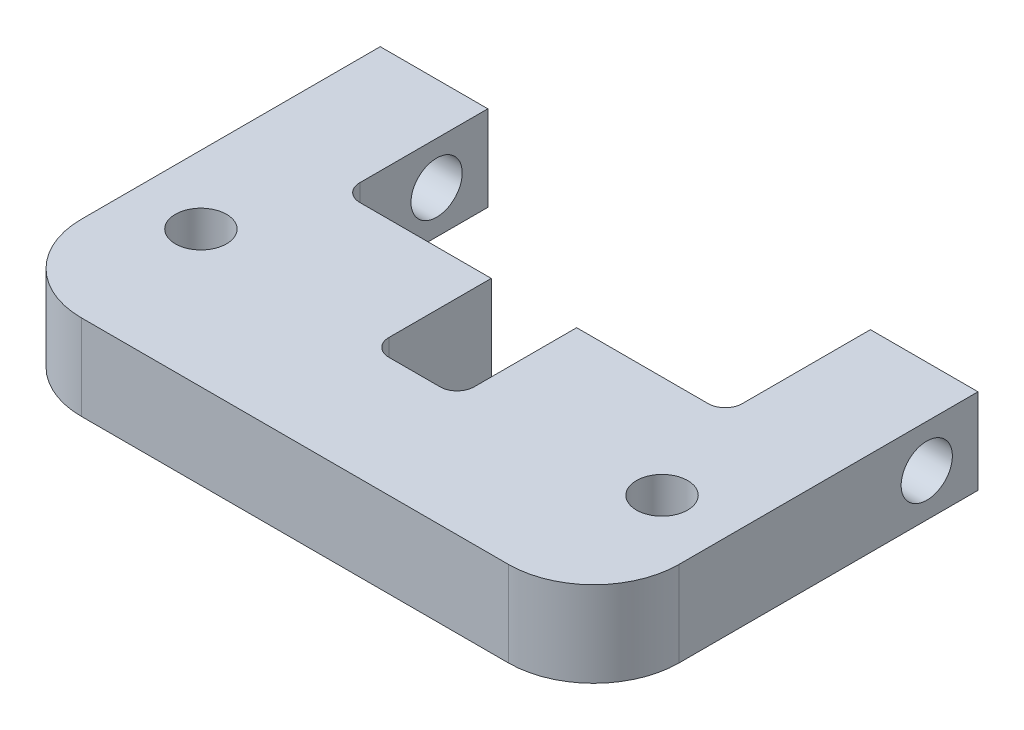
from build123d import *

# Parameters (mm, degrees)
SKIZZE1_R                       = 1.5
AUFSATZ_LINEAR_AUSTRAGEN4_DEPTH = 5
SKIZZE3_R                       = 1.5
SCHNITT_LINEAR_AUSTRAGEN2_DEPTH = 42.907636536
VERRUNDUNG1_R                   = 5


with BuildPart() as part:
    # Skizze1 → Aufsatz-Linear austragen4 (new body)
    with BuildSketch(Plane(origin=(0, 0, 0), x_dir=(1, 0, 0), z_dir=(0, 1, 0))):
        with BuildLine():
            Line((11.2, 0), (17.5, 0))
            Line((17.5, 0), (17.5, -22.5))
            Line((17.5, -22.5), (6, -22.5))
            Line((6, -22.5), (-17.5, -22.5))
            Line((-17.5, -22.5), (-17.5, 0))
            Line((-17.5, 0), (-11.2, 0))
            Line((-11.2, 0), (-11.2, -7.5))
            ThreePointArc((-11.2, -7.5), (-10.907106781, -8.207106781), (-10.2, -8.5))
            Line((-10.2, -8.5), (-2.5, -8.5))
            Line((-2.5, -8.5), (-2.5, -14.5))
            ThreePointArc((-2.5, -14.5), (-2.207106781, -15.207106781), (-1.5, -15.5))
            Line((-1.5, -15.5), (1.5, -15.5))
            ThreePointArc((1.5, -15.5), (2.207106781, -15.207106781), (2.5, -14.5))
            Line((2.5, -14.5), (2.5, -8.5))
            Line((2.5, -8.5), (10.2, -8.5))
            ThreePointArc((10.2, -8.5), (10.907106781, -8.207106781), (11.2, -7.5))
            Line((11.2, -7.5), (11.2, 0))
        make_face()
        with Locations(Location((13.5, -14.5, 0), (0, 0, 270))):
            Circle(SKIZZE1_R, mode=Mode.SUBTRACT)
        with Locations(Location((-13.5, -14.5, 0), (0, 0, 90))):
            Circle(SKIZZE1_R, mode=Mode.SUBTRACT)
    extrude(amount=AUFSATZ_LINEAR_AUSTRAGEN4_DEPTH)

    # Skizze3 → Schnitt-Linear austragen2 (cut, through all)
    with BuildSketch(Plane(origin=(17.5, 0, 0), x_dir=(0, 0, -1), z_dir=(1, 0, 0))):
        with Locations((-3, 2.5)):
            Circle(SKIZZE3_R)
    extrude(amount=-SCHNITT_LINEAR_AUSTRAGEN2_DEPTH, mode=Mode.SUBTRACT)

    # Verrundung1
    verrundung1_edges = [part.edges().sort_by_distance(p)[0] for p in [
        (17.5, 2.5, 22.5),
        (-17.5, 2.5, 22.5),
    ]]
    fillet(verrundung1_edges, radius=VERRUNDUNG1_R)


solid = part.part
